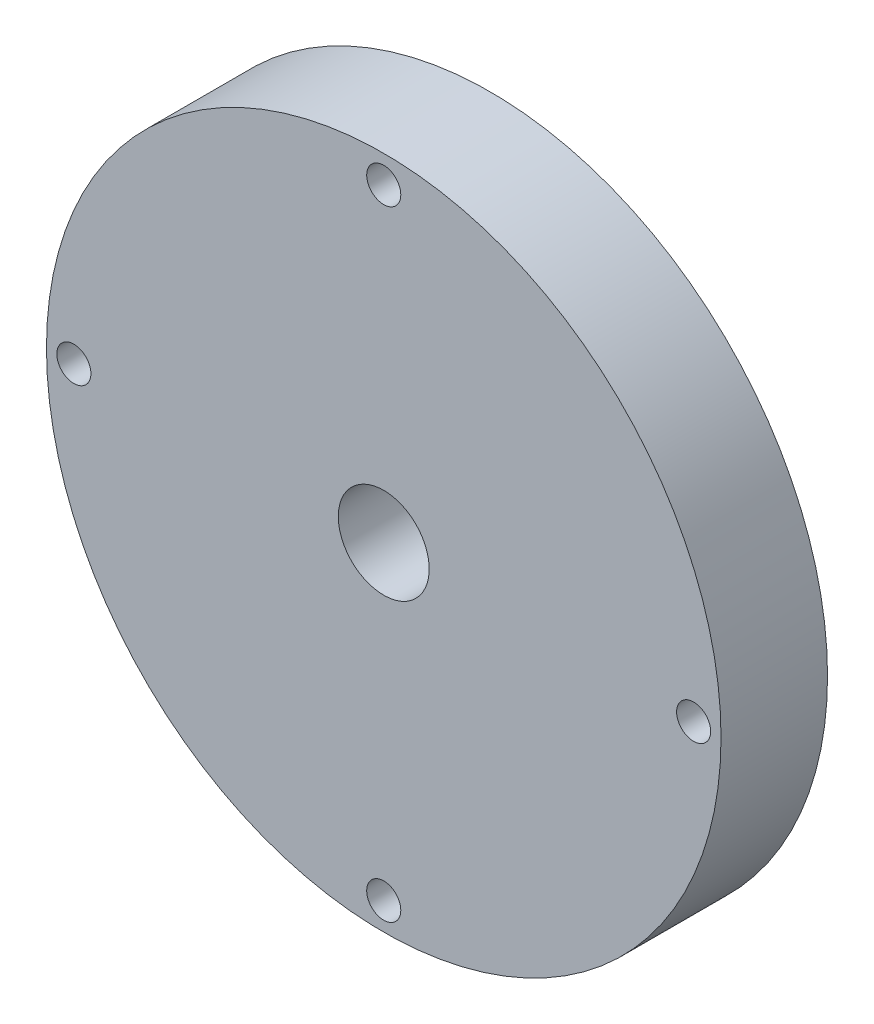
ISO-10303-21;
HEADER;
FILE_DESCRIPTION(('STEP AP214'),'2;1');
FILE_NAME('part.step','',(''),(''),'','','');
FILE_SCHEMA(('AUTOMOTIVE_DESIGN { 1 0 10303 214 1 1 1 1 }'));
ENDSEC;
DATA;
#1=APPLICATION_CONTEXT('core data for automotive mechanical design processes');
#2=APPLICATION_PROTOCOL_DEFINITION('international standard','automotive_design',2000,#1);
#3=PRODUCT_CONTEXT('',#1,'mechanical');
#4=PRODUCT('Part','Part','',(#3));
#5=PRODUCT_RELATED_PRODUCT_CATEGORY('part','',(#4));
#6=PRODUCT_DEFINITION_FORMATION('','',#4);
#7=PRODUCT_DEFINITION_CONTEXT('part definition',#1,'design');
#8=PRODUCT_DEFINITION('design','',#6,#7);
#9=PRODUCT_DEFINITION_SHAPE('','',#8);
#10=(LENGTH_UNIT() NAMED_UNIT(*) SI_UNIT(.MILLI.,.METRE.));
#11=(NAMED_UNIT(*) PLANE_ANGLE_UNIT() SI_UNIT($,.RADIAN.));
#12=(NAMED_UNIT(*) SI_UNIT($,.STERADIAN.) SOLID_ANGLE_UNIT());
#13=UNCERTAINTY_MEASURE_WITH_UNIT(LENGTH_MEASURE(1.E-05),#10,'distance_accuracy_value','');
#14=(GEOMETRIC_REPRESENTATION_CONTEXT(3) GLOBAL_UNCERTAINTY_ASSIGNED_CONTEXT((#13)) GLOBAL_UNIT_ASSIGNED_CONTEXT((#10,
#11,#12)) REPRESENTATION_CONTEXT('',''));
#15=CARTESIAN_POINT('',(0.,0.,0.));
#16=DIRECTION('',(0.,0.,1.));
#17=DIRECTION('',(1.,0.,0.));
#18=AXIS2_PLACEMENT_3D('',#15,#16,#17);
#19=CARTESIAN_POINT('',(0.,0.,9.525));
#20=DIRECTION('',(0.,0.,1.));
#21=DIRECTION('',(1.,0.,0.));
#22=AXIS2_PLACEMENT_3D('',#19,#20,#21);
#23=PLANE('',#22);
#24=CARTESIAN_POINT('',(0.,27.7114,9.525));
#25=DIRECTION('',(0.,0.,1.));
#26=DIRECTION('',(1.,0.,0.));
#27=AXIS2_PLACEMENT_3D('',#24,#25,#26);
#28=CIRCLE('',#27,1.52399999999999);
#29=CARTESIAN_POINT('',(1.52399999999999,27.7114,9.525));
#30=VERTEX_POINT('',#29);
#31=EDGE_CURVE('E70',#30,#30,#28,.T.);
#32=ORIENTED_EDGE('',*,*,#31,.F.);
#33=EDGE_LOOP('',(#32));
#34=FACE_BOUND('',#33,.T.);
#35=CARTESIAN_POINT('',(27.7114,0.,9.525));
#36=DIRECTION('',(0.,0.,1.));
#37=DIRECTION('',(1.,0.,0.));
#38=AXIS2_PLACEMENT_3D('',#35,#36,#37);
#39=CIRCLE('',#38,1.52399999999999);
#40=CARTESIAN_POINT('',(29.2354,0.,9.525));
#41=VERTEX_POINT('',#40);
#42=EDGE_CURVE('E64',#41,#41,#39,.T.);
#43=ORIENTED_EDGE('',*,*,#42,.F.);
#44=EDGE_LOOP('',(#43));
#45=FACE_BOUND('',#44,.T.);
#46=CARTESIAN_POINT('',(0.,-27.7114,9.525));
#47=DIRECTION('',(0.,0.,1.));
#48=DIRECTION('',(1.,0.,0.));
#49=AXIS2_PLACEMENT_3D('',#46,#47,#48);
#50=CIRCLE('',#49,1.52399999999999);
#51=CARTESIAN_POINT('',(1.52399999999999,-27.7114,9.525));
#52=VERTEX_POINT('',#51);
#53=EDGE_CURVE('E58',#52,#52,#50,.T.);
#54=ORIENTED_EDGE('',*,*,#53,.F.);
#55=EDGE_LOOP('',(#54));
#56=FACE_BOUND('',#55,.T.);
#57=CARTESIAN_POINT('',(-27.7114,0.,9.525));
#58=DIRECTION('',(0.,0.,1.));
#59=DIRECTION('',(1.,0.,0.));
#60=AXIS2_PLACEMENT_3D('',#57,#58,#59);
#61=CIRCLE('',#60,1.52399999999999);
#62=CARTESIAN_POINT('',(-26.1874,0.,9.525));
#63=VERTEX_POINT('',#62);
#64=EDGE_CURVE('E52',#63,#63,#61,.T.);
#65=ORIENTED_EDGE('',*,*,#64,.F.);
#66=EDGE_LOOP('',(#65));
#67=FACE_BOUND('',#66,.T.);
#68=CARTESIAN_POINT('',(0.,0.,9.525));
#69=DIRECTION('',(0.,0.,1.));
#70=DIRECTION('',(1.,0.,0.));
#71=AXIS2_PLACEMENT_3D('',#68,#69,#70);
#72=CIRCLE('',#71,30.1625);
#73=CARTESIAN_POINT('',(-30.1625,0.,9.525));
#74=VERTEX_POINT('',#73);
#75=EDGE_CURVE('E10',#74,#74,#72,.T.);
#76=ORIENTED_EDGE('',*,*,#75,.T.);
#77=EDGE_LOOP('',(#76));
#78=FACE_BOUND('',#77,.T.);
#79=CARTESIAN_POINT('',(0.,0.,9.525));
#80=DIRECTION('',(0.,0.,1.));
#81=DIRECTION('',(1.,0.,0.));
#82=AXIS2_PLACEMENT_3D('',#79,#80,#81);
#83=CIRCLE('',#82,4.064);
#84=CARTESIAN_POINT('',(-4.064,0.,9.525));
#85=VERTEX_POINT('',#84);
#86=EDGE_CURVE('E42',#85,#85,#83,.T.);
#87=ORIENTED_EDGE('',*,*,#86,.F.);
#88=EDGE_LOOP('',(#87));
#89=FACE_BOUND('',#88,.T.);
#90=ADVANCED_FACE('F31',(#34,#45,#56,#67,#78,#89),#23,.T.);
#91=CARTESIAN_POINT('',(0.,0.,0.));
#92=DIRECTION('',(0.,0.,1.));
#93=DIRECTION('',(1.,0.,0.));
#94=AXIS2_PLACEMENT_3D('',#91,#92,#93);
#95=PLANE('',#94);
#96=CARTESIAN_POINT('',(0.,27.7114,0.));
#97=DIRECTION('',(0.,0.,1.));
#98=DIRECTION('',(1.,0.,0.));
#99=AXIS2_PLACEMENT_3D('',#96,#97,#98);
#100=CIRCLE('',#99,1.524);
#101=CARTESIAN_POINT('',(1.524,27.7114,0.));
#102=VERTEX_POINT('',#101);
#103=EDGE_CURVE('E67',#102,#102,#100,.T.);
#104=ORIENTED_EDGE('',*,*,#103,.T.);
#105=EDGE_LOOP('',(#104));
#106=FACE_BOUND('',#105,.T.);
#107=CARTESIAN_POINT('',(27.7114,0.,0.));
#108=DIRECTION('',(0.,0.,1.));
#109=DIRECTION('',(1.,0.,0.));
#110=AXIS2_PLACEMENT_3D('',#107,#108,#109);
#111=CIRCLE('',#110,1.524);
#112=CARTESIAN_POINT('',(29.2354,0.,0.));
#113=VERTEX_POINT('',#112);
#114=EDGE_CURVE('E61',#113,#113,#111,.T.);
#115=ORIENTED_EDGE('',*,*,#114,.T.);
#116=EDGE_LOOP('',(#115));
#117=FACE_BOUND('',#116,.T.);
#118=CARTESIAN_POINT('',(0.,-27.7114,0.));
#119=DIRECTION('',(0.,0.,1.));
#120=DIRECTION('',(1.,0.,0.));
#121=AXIS2_PLACEMENT_3D('',#118,#119,#120);
#122=CIRCLE('',#121,1.524);
#123=CARTESIAN_POINT('',(1.524,-27.7114,0.));
#124=VERTEX_POINT('',#123);
#125=EDGE_CURVE('E55',#124,#124,#122,.T.);
#126=ORIENTED_EDGE('',*,*,#125,.T.);
#127=EDGE_LOOP('',(#126));
#128=FACE_BOUND('',#127,.T.);
#129=CARTESIAN_POINT('',(-27.7114,0.,0.));
#130=DIRECTION('',(0.,0.,1.));
#131=DIRECTION('',(1.,0.,0.));
#132=AXIS2_PLACEMENT_3D('',#129,#130,#131);
#133=CIRCLE('',#132,1.524);
#134=CARTESIAN_POINT('',(-26.1874,0.,0.));
#135=VERTEX_POINT('',#134);
#136=EDGE_CURVE('E47',#135,#135,#133,.T.);
#137=ORIENTED_EDGE('',*,*,#136,.T.);
#138=EDGE_LOOP('',(#137));
#139=FACE_BOUND('',#138,.T.);
#140=CARTESIAN_POINT('',(0.,0.,0.));
#141=DIRECTION('',(0.,0.,1.));
#142=DIRECTION('',(1.,0.,0.));
#143=AXIS2_PLACEMENT_3D('',#140,#141,#142);
#144=CIRCLE('',#143,30.1625);
#145=CARTESIAN_POINT('',(-30.1625,0.,0.));
#146=VERTEX_POINT('',#145);
#147=EDGE_CURVE('E35',#146,#146,#144,.T.);
#148=ORIENTED_EDGE('',*,*,#147,.F.);
#149=EDGE_LOOP('',(#148));
#150=FACE_BOUND('',#149,.T.);
#151=CARTESIAN_POINT('',(0.,0.,0.));
#152=DIRECTION('',(0.,0.,1.));
#153=DIRECTION('',(1.,0.,0.));
#154=AXIS2_PLACEMENT_3D('',#151,#152,#153);
#155=CIRCLE('',#154,4.064);
#156=CARTESIAN_POINT('',(-4.064,0.,0.));
#157=VERTEX_POINT('',#156);
#158=EDGE_CURVE('E44',#157,#157,#155,.T.);
#159=ORIENTED_EDGE('',*,*,#158,.T.);
#160=EDGE_LOOP('',(#159));
#161=FACE_BOUND('',#160,.T.);
#162=ADVANCED_FACE('F78',(#106,#117,#128,#139,#150,#161),#95,.F.);
#163=CARTESIAN_POINT('',(0.,0.,9.525));
#164=DIRECTION('',(0.,0.,-1.));
#165=DIRECTION('',(-1.,0.,0.));
#166=AXIS2_PLACEMENT_3D('',#163,#164,#165);
#167=CYLINDRICAL_SURFACE('',#166,30.1625);
#168=CARTESIAN_POINT('',(-30.1625,0.,9.525));
#169=CARTESIAN_POINT('',(-30.1625,0.,9.42578125));
#170=CARTESIAN_POINT('',(-30.1625,0.,9.3265625));
#171=CARTESIAN_POINT('',(-30.1625,0.,9.128125));
#172=CARTESIAN_POINT('',(-30.1625,0.,9.02890625));
#173=CARTESIAN_POINT('',(-30.1625,0.,8.83046875));
#174=CARTESIAN_POINT('',(-30.1625,0.,8.73125));
#175=CARTESIAN_POINT('',(-30.1625,0.,8.5328125));
#176=CARTESIAN_POINT('',(-30.1625,0.,8.43359375));
#177=CARTESIAN_POINT('',(-30.1625,0.,8.23515625));
#178=CARTESIAN_POINT('',(-30.1625,0.,8.1359375));
#179=CARTESIAN_POINT('',(-30.1625,0.,7.9375));
#180=CARTESIAN_POINT('',(-30.1625,0.,7.83828125));
#181=CARTESIAN_POINT('',(-30.1625,0.,7.63984375));
#182=CARTESIAN_POINT('',(-30.1625,0.,7.540625));
#183=CARTESIAN_POINT('',(-30.1625,0.,7.3421875));
#184=CARTESIAN_POINT('',(-30.1625,0.,7.24296875));
#185=CARTESIAN_POINT('',(-30.1625,0.,7.04453125));
#186=CARTESIAN_POINT('',(-30.1625,0.,6.9453125));
#187=CARTESIAN_POINT('',(-30.1625,0.,6.746875));
#188=CARTESIAN_POINT('',(-30.1625,0.,6.64765625));
#189=CARTESIAN_POINT('',(-30.1625,0.,6.44921875));
#190=CARTESIAN_POINT('',(-30.1625,0.,6.35));
#191=CARTESIAN_POINT('',(-30.1625,0.,6.1515625));
#192=CARTESIAN_POINT('',(-30.1625,0.,6.05234375));
#193=CARTESIAN_POINT('',(-30.1625,0.,5.85390625));
#194=CARTESIAN_POINT('',(-30.1625,0.,5.7546875));
#195=CARTESIAN_POINT('',(-30.1625,0.,5.55625));
#196=CARTESIAN_POINT('',(-30.1625,0.,5.45703125));
#197=CARTESIAN_POINT('',(-30.1625,0.,5.25859375));
#198=CARTESIAN_POINT('',(-30.1625,0.,5.159375));
#199=CARTESIAN_POINT('',(-30.1625,0.,4.9609375));
#200=CARTESIAN_POINT('',(-30.1625,0.,4.86171875));
#201=CARTESIAN_POINT('',(-30.1625,0.,4.66328125));
#202=CARTESIAN_POINT('',(-30.1625,0.,4.5640625));
#203=CARTESIAN_POINT('',(-30.1625,0.,4.365625));
#204=CARTESIAN_POINT('',(-30.1625,0.,4.26640625));
#205=CARTESIAN_POINT('',(-30.1625,0.,4.06796875));
#206=CARTESIAN_POINT('',(-30.1625,0.,3.96875));
#207=CARTESIAN_POINT('',(-30.1625,0.,3.7703125));
#208=CARTESIAN_POINT('',(-30.1625,0.,3.67109375));
#209=CARTESIAN_POINT('',(-30.1625,0.,3.47265625));
#210=CARTESIAN_POINT('',(-30.1625,0.,3.3734375));
#211=CARTESIAN_POINT('',(-30.1625,0.,3.175));
#212=CARTESIAN_POINT('',(-30.1625,0.,3.07578125));
#213=CARTESIAN_POINT('',(-30.1625,0.,2.87734375));
#214=CARTESIAN_POINT('',(-30.1625,0.,2.778125));
#215=CARTESIAN_POINT('',(-30.1625,0.,2.5796875));
#216=CARTESIAN_POINT('',(-30.1625,0.,2.48046875));
#217=CARTESIAN_POINT('',(-30.1625,0.,2.28203125));
#218=CARTESIAN_POINT('',(-30.1625,0.,2.1828125));
#219=CARTESIAN_POINT('',(-30.1625,0.,1.984375));
#220=CARTESIAN_POINT('',(-30.1625,0.,1.88515625));
#221=CARTESIAN_POINT('',(-30.1625,0.,1.68671875));
#222=CARTESIAN_POINT('',(-30.1625,0.,1.5875));
#223=CARTESIAN_POINT('',(-30.1625,0.,1.3890625));
#224=CARTESIAN_POINT('',(-30.1625,0.,1.28984375));
#225=CARTESIAN_POINT('',(-30.1625,0.,1.09140625));
#226=CARTESIAN_POINT('',(-30.1625,0.,0.992187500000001));
#227=CARTESIAN_POINT('',(-30.1625,0.,0.793750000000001));
#228=CARTESIAN_POINT('',(-30.1625,0.,0.69453125));
#229=CARTESIAN_POINT('',(-30.1625,0.,0.49609375));
#230=CARTESIAN_POINT('',(-30.1625,0.,0.396875));
#231=CARTESIAN_POINT('',(-30.1625,0.,0.1984375));
#232=CARTESIAN_POINT('',(-30.1625,0.,0.0992187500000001));
#233=CARTESIAN_POINT('',(-30.1625,0.,0.));
#234=B_SPLINE_CURVE_WITH_KNOTS('',3,(#168,#169,#170,#171,#172,#173,#174,#175,#176,#177,#178,
#179,#180,#181,#182,#183,#184,#185,#186,#187,#188,#189,#190,#191,#192,#193,#194,#195,#196,#197,
#198,#199,#200,#201,#202,#203,#204,#205,#206,#207,#208,#209,#210,#211,#212,#213,#214,#215,#216,
#217,#218,#219,#220,#221,#222,#223,#224,#225,#226,#227,#228,#229,#230,#231,#232,#233),
.UNSPECIFIED.,.F.,.F.,(4,2,2,2,2,2,2,2,2,2,2,2,2,2,2,2,2,2,2,2,2,2,2,2,2,2,2,2,2,2,2,2,4),(0.,
0.29765625,0.5953125,0.892968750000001,1.190625,1.48828125,1.7859375,2.08359375,2.38125,
2.67890625,2.9765625,3.27421875,3.571875,3.86953125,4.1671875,4.46484375,4.7625,5.06015625,
5.3578125,5.65546875,5.953125,6.25078125,6.5484375,6.84609375,7.14375,7.44140625,7.7390625,
8.03671875,8.334375,8.63203125,8.9296875,9.22734375,9.525),.UNSPECIFIED.);
#235=EDGE_CURVE('BSEAM33',#74,#146,#234,.T.);
#236=ORIENTED_EDGE('',*,*,#75,.F.);
#237=ORIENTED_EDGE('',*,*,#147,.T.);
#238=ORIENTED_EDGE('',*,*,#235,.T.);
#239=ORIENTED_EDGE('',*,*,#235,.F.);
#240=EDGE_LOOP('',(#236,#238,#237,#239));
#241=FACE_BOUND('',#240,.T.);
#242=ADVANCED_FACE('F33',(#241),#167,.T.);
#243=CARTESIAN_POINT('',(0.,0.,9.525));
#244=DIRECTION('',(0.,0.,-1.));
#245=DIRECTION('',(-1.,0.,0.));
#246=AXIS2_PLACEMENT_3D('',#243,#244,#245);
#247=CYLINDRICAL_SURFACE('',#246,4.064);
#248=CARTESIAN_POINT('',(-4.064,0.,9.525));
#249=CARTESIAN_POINT('',(-4.064,0.,9.42578125));
#250=CARTESIAN_POINT('',(-4.064,0.,9.3265625));
#251=CARTESIAN_POINT('',(-4.064,0.,9.128125));
#252=CARTESIAN_POINT('',(-4.064,0.,9.02890625));
#253=CARTESIAN_POINT('',(-4.064,0.,8.83046875));
#254=CARTESIAN_POINT('',(-4.064,0.,8.73125));
#255=CARTESIAN_POINT('',(-4.064,0.,8.5328125));
#256=CARTESIAN_POINT('',(-4.064,0.,8.43359375));
#257=CARTESIAN_POINT('',(-4.064,0.,8.23515625));
#258=CARTESIAN_POINT('',(-4.064,0.,8.1359375));
#259=CARTESIAN_POINT('',(-4.064,0.,7.9375));
#260=CARTESIAN_POINT('',(-4.064,0.,7.83828125));
#261=CARTESIAN_POINT('',(-4.064,0.,7.63984375));
#262=CARTESIAN_POINT('',(-4.064,0.,7.540625));
#263=CARTESIAN_POINT('',(-4.064,0.,7.3421875));
#264=CARTESIAN_POINT('',(-4.064,0.,7.24296875));
#265=CARTESIAN_POINT('',(-4.064,0.,7.04453125));
#266=CARTESIAN_POINT('',(-4.064,0.,6.9453125));
#267=CARTESIAN_POINT('',(-4.064,0.,6.746875));
#268=CARTESIAN_POINT('',(-4.064,0.,6.64765625));
#269=CARTESIAN_POINT('',(-4.064,0.,6.44921875));
#270=CARTESIAN_POINT('',(-4.064,0.,6.35));
#271=CARTESIAN_POINT('',(-4.064,0.,6.1515625));
#272=CARTESIAN_POINT('',(-4.064,0.,6.05234375));
#273=CARTESIAN_POINT('',(-4.064,0.,5.85390625));
#274=CARTESIAN_POINT('',(-4.064,0.,5.7546875));
#275=CARTESIAN_POINT('',(-4.064,0.,5.55625));
#276=CARTESIAN_POINT('',(-4.064,0.,5.45703125));
#277=CARTESIAN_POINT('',(-4.064,0.,5.25859375));
#278=CARTESIAN_POINT('',(-4.064,0.,5.159375));
#279=CARTESIAN_POINT('',(-4.064,0.,4.9609375));
#280=CARTESIAN_POINT('',(-4.064,0.,4.86171875));
#281=CARTESIAN_POINT('',(-4.064,0.,4.66328125));
#282=CARTESIAN_POINT('',(-4.064,0.,4.5640625));
#283=CARTESIAN_POINT('',(-4.064,0.,4.365625));
#284=CARTESIAN_POINT('',(-4.064,0.,4.26640625));
#285=CARTESIAN_POINT('',(-4.064,0.,4.06796875));
#286=CARTESIAN_POINT('',(-4.064,0.,3.96875));
#287=CARTESIAN_POINT('',(-4.064,0.,3.7703125));
#288=CARTESIAN_POINT('',(-4.064,0.,3.67109375));
#289=CARTESIAN_POINT('',(-4.064,0.,3.47265625));
#290=CARTESIAN_POINT('',(-4.064,0.,3.3734375));
#291=CARTESIAN_POINT('',(-4.064,0.,3.175));
#292=CARTESIAN_POINT('',(-4.064,0.,3.07578125));
#293=CARTESIAN_POINT('',(-4.064,0.,2.87734375));
#294=CARTESIAN_POINT('',(-4.064,0.,2.778125));
#295=CARTESIAN_POINT('',(-4.064,0.,2.5796875));
#296=CARTESIAN_POINT('',(-4.064,0.,2.48046875));
#297=CARTESIAN_POINT('',(-4.064,0.,2.28203125));
#298=CARTESIAN_POINT('',(-4.064,0.,2.1828125));
#299=CARTESIAN_POINT('',(-4.064,0.,1.984375));
#300=CARTESIAN_POINT('',(-4.064,0.,1.88515625));
#301=CARTESIAN_POINT('',(-4.064,0.,1.68671875));
#302=CARTESIAN_POINT('',(-4.064,0.,1.5875));
#303=CARTESIAN_POINT('',(-4.064,0.,1.3890625));
#304=CARTESIAN_POINT('',(-4.064,0.,1.28984375));
#305=CARTESIAN_POINT('',(-4.064,0.,1.09140625));
#306=CARTESIAN_POINT('',(-4.064,0.,0.992187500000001));
#307=CARTESIAN_POINT('',(-4.064,0.,0.793750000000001));
#308=CARTESIAN_POINT('',(-4.064,0.,0.69453125));
#309=CARTESIAN_POINT('',(-4.064,0.,0.49609375));
#310=CARTESIAN_POINT('',(-4.064,0.,0.396875));
#311=CARTESIAN_POINT('',(-4.064,0.,0.1984375));
#312=CARTESIAN_POINT('',(-4.064,0.,0.0992187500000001));
#313=CARTESIAN_POINT('',(-4.064,0.,0.));
#314=B_SPLINE_CURVE_WITH_KNOTS('',3,(#248,#249,#250,#251,#252,#253,#254,#255,#256,#257,#258,
#259,#260,#261,#262,#263,#264,#265,#266,#267,#268,#269,#270,#271,#272,#273,#274,#275,#276,#277,
#278,#279,#280,#281,#282,#283,#284,#285,#286,#287,#288,#289,#290,#291,#292,#293,#294,#295,#296,
#297,#298,#299,#300,#301,#302,#303,#304,#305,#306,#307,#308,#309,#310,#311,#312,#313),
.UNSPECIFIED.,.F.,.F.,(4,2,2,2,2,2,2,2,2,2,2,2,2,2,2,2,2,2,2,2,2,2,2,2,2,2,2,2,2,2,2,2,4),(0.,
0.29765625,0.5953125,0.892968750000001,1.190625,1.48828125,1.7859375,2.08359375,2.38125,
2.67890625,2.9765625,3.27421875,3.571875,3.86953125,4.1671875,4.46484375,4.7625,5.06015625,
5.3578125,5.65546875,5.953125,6.25078125,6.5484375,6.84609375,7.14375,7.44140625,7.7390625,
8.03671875,8.334375,8.63203125,8.9296875,9.22734375,9.525),.UNSPECIFIED.);
#315=EDGE_CURVE('BSEAM88',#85,#157,#314,.T.);
#316=ORIENTED_EDGE('',*,*,#86,.T.);
#317=ORIENTED_EDGE('',*,*,#158,.F.);
#318=ORIENTED_EDGE('',*,*,#315,.T.);
#319=ORIENTED_EDGE('',*,*,#315,.F.);
#320=EDGE_LOOP('',(#316,#318,#317,#319));
#321=FACE_BOUND('',#320,.T.);
#322=ADVANCED_FACE('F88',(#321),#247,.F.);
#323=CARTESIAN_POINT('',(-27.7114,0.,9.525));
#324=DIRECTION('',(0.,0.,1.));
#325=DIRECTION('',(1.,0.,0.));
#326=AXIS2_PLACEMENT_3D('',#323,#324,#325);
#327=CYLINDRICAL_SURFACE('',#326,1.52399999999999);
#328=ORIENTED_EDGE('',*,*,#136,.F.);
#329=EDGE_LOOP('',(#328));
#330=FACE_BOUND('',#329,.T.);
#331=ORIENTED_EDGE('',*,*,#64,.T.);
#332=EDGE_LOOP('',(#331));
#333=FACE_BOUND('',#332,.T.);
#334=ADVANCED_FACE('F91',(#330,#333),#327,.F.);
#335=CARTESIAN_POINT('',(0.,-27.7114,9.525));
#336=DIRECTION('',(0.,0.,1.));
#337=DIRECTION('',(1.,0.,0.));
#338=AXIS2_PLACEMENT_3D('',#335,#336,#337);
#339=CYLINDRICAL_SURFACE('',#338,1.52399999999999);
#340=ORIENTED_EDGE('',*,*,#125,.F.);
#341=EDGE_LOOP('',(#340));
#342=FACE_BOUND('',#341,.T.);
#343=ORIENTED_EDGE('',*,*,#53,.T.);
#344=EDGE_LOOP('',(#343));
#345=FACE_BOUND('',#344,.T.);
#346=ADVANCED_FACE('F106',(#342,#345),#339,.F.);
#347=CARTESIAN_POINT('',(27.7114,0.,9.525));
#348=DIRECTION('',(0.,0.,1.));
#349=DIRECTION('',(1.,0.,0.));
#350=AXIS2_PLACEMENT_3D('',#347,#348,#349);
#351=CYLINDRICAL_SURFACE('',#350,1.52399999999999);
#352=ORIENTED_EDGE('',*,*,#114,.F.);
#353=EDGE_LOOP('',(#352));
#354=FACE_BOUND('',#353,.T.);
#355=ORIENTED_EDGE('',*,*,#42,.T.);
#356=EDGE_LOOP('',(#355));
#357=FACE_BOUND('',#356,.T.);
#358=ADVANCED_FACE('F110',(#354,#357),#351,.F.);
#359=CARTESIAN_POINT('',(0.,27.7114,9.525));
#360=DIRECTION('',(0.,0.,1.));
#361=DIRECTION('',(1.,0.,0.));
#362=AXIS2_PLACEMENT_3D('',#359,#360,#361);
#363=CYLINDRICAL_SURFACE('',#362,1.52399999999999);
#364=ORIENTED_EDGE('',*,*,#103,.F.);
#365=EDGE_LOOP('',(#364));
#366=FACE_BOUND('',#365,.T.);
#367=ORIENTED_EDGE('',*,*,#31,.T.);
#368=EDGE_LOOP('',(#367));
#369=FACE_BOUND('',#368,.T.);
#370=ADVANCED_FACE('F74',(#366,#369),#363,.F.);
#371=CLOSED_SHELL('',(#90,#162,#242,#322,#334,#346,#358,#370));
#372=MANIFOLD_SOLID_BREP('B2',#371);
#373=ADVANCED_BREP_SHAPE_REPRESENTATION('',(#18,#372),#14);
#374=SHAPE_DEFINITION_REPRESENTATION(#9,#373);
ENDSEC;
END-ISO-10303-21;
